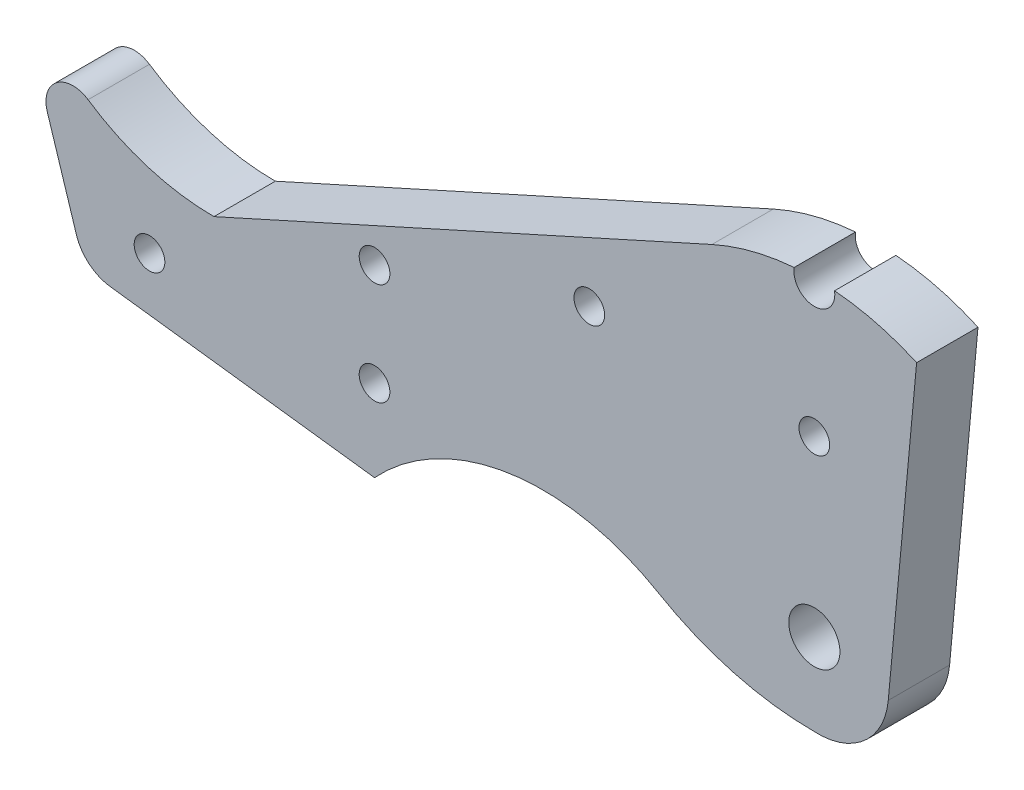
ISO-10303-21;
HEADER;
FILE_DESCRIPTION(('STEP AP214'),'2;1');
FILE_NAME('part.step','',(''),(''),'','','');
FILE_SCHEMA(('AUTOMOTIVE_DESIGN { 1 0 10303 214 1 1 1 1 }'));
ENDSEC;
DATA;
#1=APPLICATION_CONTEXT('core data for automotive mechanical design processes');
#2=APPLICATION_PROTOCOL_DEFINITION('international standard','automotive_design',2000,#1);
#3=PRODUCT_CONTEXT('',#1,'mechanical');
#4=PRODUCT('Part','Part','',(#3));
#5=PRODUCT_RELATED_PRODUCT_CATEGORY('part','',(#4));
#6=PRODUCT_DEFINITION_FORMATION('','',#4);
#7=PRODUCT_DEFINITION_CONTEXT('part definition',#1,'design');
#8=PRODUCT_DEFINITION('design','',#6,#7);
#9=PRODUCT_DEFINITION_SHAPE('','',#8);
#10=(LENGTH_UNIT() NAMED_UNIT(*) SI_UNIT(.MILLI.,.METRE.));
#11=(NAMED_UNIT(*) PLANE_ANGLE_UNIT() SI_UNIT($,.RADIAN.));
#12=(NAMED_UNIT(*) SI_UNIT($,.STERADIAN.) SOLID_ANGLE_UNIT());
#13=UNCERTAINTY_MEASURE_WITH_UNIT(LENGTH_MEASURE(1.E-05),#10,'distance_accuracy_value','');
#14=(GEOMETRIC_REPRESENTATION_CONTEXT(3) GLOBAL_UNCERTAINTY_ASSIGNED_CONTEXT((#13)) GLOBAL_UNIT_ASSIGNED_CONTEXT((#10,
#11,#12)) REPRESENTATION_CONTEXT('',''));
#15=CARTESIAN_POINT('',(0.,0.,0.));
#16=DIRECTION('',(0.,0.,1.));
#17=DIRECTION('',(1.,0.,0.));
#18=AXIS2_PLACEMENT_3D('',#15,#16,#17);
#19=CARTESIAN_POINT('',(74.9933862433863,14.0803286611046,6.));
#20=DIRECTION('',(0.,0.,-1.));
#21=DIRECTION('',(-1.,0.,0.));
#22=AXIS2_PLACEMENT_3D('',#19,#20,#21);
#23=PLANE('',#22);
#24=CARTESIAN_POINT('',(32.,8.,6.));
#25=DIRECTION('',(0.,0.,1.));
#26=DIRECTION('',(1.,0.,0.));
#27=AXIS2_PLACEMENT_3D('',#24,#25,#26);
#28=CIRCLE('',#27,1.5);
#29=CARTESIAN_POINT('',(33.5,8.,6.));
#30=VERTEX_POINT('',#29);
#31=EDGE_CURVE('E330',#30,#30,#28,.T.);
#32=ORIENTED_EDGE('',*,*,#31,.F.);
#33=EDGE_LOOP('',(#32));
#34=FACE_BOUND('',#33,.T.);
#35=CARTESIAN_POINT('',(53.,25.,6.));
#36=DIRECTION('',(0.,0.,1.));
#37=DIRECTION('',(1.,0.,0.));
#38=AXIS2_PLACEMENT_3D('',#35,#36,#37);
#39=CIRCLE('',#38,1.5);
#40=CARTESIAN_POINT('',(54.5,25.,6.));
#41=VERTEX_POINT('',#40);
#42=EDGE_CURVE('E342',#41,#41,#39,.T.);
#43=ORIENTED_EDGE('',*,*,#42,.F.);
#44=EDGE_LOOP('',(#43));
#45=FACE_BOUND('',#44,.T.);
#46=CARTESIAN_POINT('',(75.,25.,6.));
#47=DIRECTION('',(0.,0.,1.));
#48=DIRECTION('',(1.,0.,0.));
#49=AXIS2_PLACEMENT_3D('',#46,#47,#48);
#50=CIRCLE('',#49,1.5);
#51=CARTESIAN_POINT('',(76.5,25.,6.));
#52=VERTEX_POINT('',#51);
#53=EDGE_CURVE('E144',#52,#52,#50,.T.);
#54=ORIENTED_EDGE('',*,*,#53,.F.);
#55=EDGE_LOOP('',(#54));
#56=FACE_BOUND('',#55,.T.);
#57=CARTESIAN_POINT('',(74.9933862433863,14.0803286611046,6.));
#58=DIRECTION('',(0.,0.,1.));
#59=DIRECTION('',(-1.,0.,0.));
#60=AXIS2_PLACEMENT_3D('',#57,#58,#59);
#61=CIRCLE('',#60,24.3141337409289);
#62=CARTESIAN_POINT('',(85.,36.2398589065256,6.));
#63=VERTEX_POINT('',#62);
#64=CARTESIAN_POINT('',(76.9752679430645,38.3135547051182,6.));
#65=VERTEX_POINT('',#64);
#66=EDGE_CURVE('E172',#63,#65,#61,.T.);
#67=ORIENTED_EDGE('',*,*,#66,.T.);
#68=CARTESIAN_POINT('',(75.,38.,6.));
#69=DIRECTION('',(0.,0.,-1.));
#70=DIRECTION('',(1.,0.,0.));
#71=AXIS2_PLACEMENT_3D('',#68,#69,#70);
#72=CIRCLE('',#71,2.00000000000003);
#73=CARTESIAN_POINT('',(73.0249057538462,38.3146469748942,6.));
#74=VERTEX_POINT('',#73);
#75=EDGE_CURVE('E139',#65,#74,#72,.T.);
#76=ORIENTED_EDGE('',*,*,#75,.T.);
#77=CARTESIAN_POINT('',(74.9933862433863,14.0803286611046,6.));
#78=DIRECTION('',(0.,0.,1.));
#79=DIRECTION('',(-1.,0.,0.));
#80=AXIS2_PLACEMENT_3D('',#77,#78,#79);
#81=CIRCLE('',#80,24.3141337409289);
#82=CARTESIAN_POINT('',(64.9867724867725,36.2398589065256,6.));
#83=VERTEX_POINT('',#82);
#84=EDGE_CURVE('E175',#74,#83,#81,.T.);
#85=ORIENTED_EDGE('',*,*,#84,.T.);
#86=DIRECTION('',(-0.911384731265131,-0.411555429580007,0.));
#87=VECTOR('',#86,1.);
#88=CARTESIAN_POINT('',(16.3045020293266,14.2563298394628,6.));
#89=LINE('',#88,#87);
#90=CARTESIAN_POINT('',(16.3045020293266,14.2563298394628,6.));
#91=VERTEX_POINT('',#90);
#92=EDGE_CURVE('E177',#83,#91,#89,.T.);
#93=ORIENTED_EDGE('',*,*,#92,.T.);
#94=CARTESIAN_POINT('',(16.3045020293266,36.3650824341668,6.));
#95=DIRECTION('',(0.,0.,-1.));
#96=DIRECTION('',(1.,0.,0.));
#97=AXIS2_PLACEMENT_3D('',#94,#95,#96);
#98=CIRCLE('',#97,22.1087525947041);
#99=CARTESIAN_POINT('',(3.99512802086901,18.,6.));
#100=VERTEX_POINT('',#99);
#101=EDGE_CURVE('E179',#91,#100,#98,.T.);
#102=ORIENTED_EDGE('',*,*,#101,.T.);
#103=CARTESIAN_POINT('',(2.5220277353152,15.8021946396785,6.));
#104=DIRECTION('',(0.,0.,1.));
#105=DIRECTION('',(-1.,0.,0.));
#106=AXIS2_PLACEMENT_3D('',#103,#104,#105);
#107=CIRCLE('',#106,2.64582177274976);
#108=CARTESIAN_POINT('',(0.,15.0023515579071,6.));
#109=VERTEX_POINT('',#108);
#110=EDGE_CURVE('E181',#100,#109,#107,.T.);
#111=ORIENTED_EDGE('',*,*,#110,.T.);
#112=DIRECTION('',(0.302304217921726,-0.95321149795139,0.));
#113=VECTOR('',#112,1.);
#114=CARTESIAN_POINT('',(2.77336860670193,6.25749559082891,6.));
#115=LINE('',#114,#113);
#116=CARTESIAN_POINT('',(2.77336860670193,6.25749559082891,6.));
#117=VERTEX_POINT('',#116);
#118=EDGE_CURVE('E183',#109,#117,#115,.T.);
#119=ORIENTED_EDGE('',*,*,#118,.T.);
#120=CARTESIAN_POINT('',(6.64532091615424,7.21700234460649,6.));
#121=DIRECTION('',(0.,0.,1.));
#122=DIRECTION('',(-1.,0.,0.));
#123=AXIS2_PLACEMENT_3D('',#120,#121,#122);
#124=CIRCLE('',#123,3.98906855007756);
#125=CARTESIAN_POINT('',(6.14638447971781,3.25925925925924,6.));
#126=VERTEX_POINT('',#125);
#127=EDGE_CURVE('E185',#117,#126,#124,.T.);
#128=ORIENTED_EDGE('',*,*,#127,.T.);
#129=DIRECTION('',(0.99214717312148,-0.125075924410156,0.));
#130=VECTOR('',#129,1.);
#131=CARTESIAN_POINT('',(32.,0.,6.));
#132=LINE('',#131,#130);
#133=CARTESIAN_POINT('',(32.,0.,6.));
#134=VERTEX_POINT('',#133);
#135=EDGE_CURVE('E187',#126,#134,#132,.T.);
#136=ORIENTED_EDGE('',*,*,#135,.T.);
#137=CARTESIAN_POINT('',(48.4415737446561,-15.1903730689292,6.));
#138=DIRECTION('',(0.,0.,-1.));
#139=DIRECTION('',(1.,0.,0.));
#140=AXIS2_PLACEMENT_3D('',#137,#138,#139);
#141=CIRCLE('',#140,22.3846550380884);
#142=CARTESIAN_POINT('',(59.7398589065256,4.13374485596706,6.));
#143=VERTEX_POINT('',#142);
#144=EDGE_CURVE('E189',#134,#143,#141,.T.);
#145=ORIENTED_EDGE('',*,*,#144,.T.);
#146=CARTESIAN_POINT('',(75.,30.234056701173,6.));
#147=DIRECTION('',(0.,0.,1.));
#148=DIRECTION('',(-1.,0.,0.));
#149=AXIS2_PLACEMENT_3D('',#146,#147,#148);
#150=CIRCLE('',#149,30.234056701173);
#151=CARTESIAN_POINT('',(75.,0.,6.));
#152=VERTEX_POINT('',#151);
#153=EDGE_CURVE('E191',#143,#152,#150,.T.);
#154=ORIENTED_EDGE('',*,*,#153,.T.);
#155=CARTESIAN_POINT('',(75.3536604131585,6.89324540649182,6.));
#156=DIRECTION('',(0.,0.,1.));
#157=DIRECTION('',(-1.,0.,0.));
#158=AXIS2_PLACEMENT_3D('',#155,#156,#157);
#159=CIRCLE('',#158,6.9023117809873);
#160=CARTESIAN_POINT('',(82.2266313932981,6.25749559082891,6.));
#161=VERTEX_POINT('',#160);
#162=EDGE_CURVE('E50',#152,#161,#159,.T.);
#163=ORIENTED_EDGE('',*,*,#162,.T.);
#164=DIRECTION('',(0.0921067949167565,0.995749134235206,0.));
#165=VECTOR('',#164,1.);
#166=CARTESIAN_POINT('',(85.,36.2398589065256,6.));
#167=LINE('',#166,#165);
#168=EDGE_CURVE('E45',#161,#63,#167,.T.);
#169=ORIENTED_EDGE('',*,*,#168,.T.);
#170=EDGE_LOOP('',(#67,#76,#85,#93,#102,#111,#119,#128,#136,#145,#154,#163,#169));
#171=FACE_BOUND('',#170,.T.);
#172=CARTESIAN_POINT('',(75.,8.,6.));
#173=DIRECTION('',(0.,0.,1.));
#174=DIRECTION('',(1.,0.,0.));
#175=AXIS2_PLACEMENT_3D('',#172,#173,#174);
#176=CIRCLE('',#175,2.5);
#177=CARTESIAN_POINT('',(77.5,8.,6.));
#178=VERTEX_POINT('',#177);
#179=EDGE_CURVE('E348',#178,#178,#176,.T.);
#180=ORIENTED_EDGE('',*,*,#179,.F.);
#181=EDGE_LOOP('',(#180));
#182=FACE_BOUND('',#181,.T.);
#183=CARTESIAN_POINT('',(32.,18.,6.));
#184=DIRECTION('',(0.,0.,1.));
#185=DIRECTION('',(1.,0.,0.));
#186=AXIS2_PLACEMENT_3D('',#183,#184,#185);
#187=CIRCLE('',#186,1.5);
#188=CARTESIAN_POINT('',(33.5,18.,6.));
#189=VERTEX_POINT('',#188);
#190=EDGE_CURVE('E336',#189,#189,#187,.T.);
#191=ORIENTED_EDGE('',*,*,#190,.F.);
#192=EDGE_LOOP('',(#191));
#193=FACE_BOUND('',#192,.T.);
#194=CARTESIAN_POINT('',(10.,8.,6.));
#195=DIRECTION('',(0.,0.,1.));
#196=DIRECTION('',(1.,0.,0.));
#197=AXIS2_PLACEMENT_3D('',#194,#195,#196);
#198=CIRCLE('',#197,1.5);
#199=CARTESIAN_POINT('',(11.5,8.,6.));
#200=VERTEX_POINT('',#199);
#201=EDGE_CURVE('E319',#200,#200,#198,.T.);
#202=ORIENTED_EDGE('',*,*,#201,.F.);
#203=EDGE_LOOP('',(#202));
#204=FACE_BOUND('',#203,.T.);
#205=ADVANCED_FACE('F30',(#34,#45,#56,#171,#182,#193,#204),#23,.F.);
#206=CARTESIAN_POINT('',(74.9933862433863,14.0803286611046,0.));
#207=DIRECTION('',(0.,0.,-1.));
#208=DIRECTION('',(-1.,0.,0.));
#209=AXIS2_PLACEMENT_3D('',#206,#207,#208);
#210=PLANE('',#209);
#211=CARTESIAN_POINT('',(32.,8.,0.));
#212=DIRECTION('',(0.,0.,1.));
#213=DIRECTION('',(1.,0.,0.));
#214=AXIS2_PLACEMENT_3D('',#211,#212,#213);
#215=CIRCLE('',#214,1.5);
#216=CARTESIAN_POINT('',(33.5,8.,0.));
#217=VERTEX_POINT('',#216);
#218=EDGE_CURVE('E325',#217,#217,#215,.T.);
#219=ORIENTED_EDGE('',*,*,#218,.T.);
#220=EDGE_LOOP('',(#219));
#221=FACE_BOUND('',#220,.T.);
#222=CARTESIAN_POINT('',(53.,25.,0.));
#223=DIRECTION('',(0.,0.,1.));
#224=DIRECTION('',(1.,0.,0.));
#225=AXIS2_PLACEMENT_3D('',#222,#223,#224);
#226=CIRCLE('',#225,1.5);
#227=CARTESIAN_POINT('',(54.5,25.,0.));
#228=VERTEX_POINT('',#227);
#229=EDGE_CURVE('E339',#228,#228,#226,.T.);
#230=ORIENTED_EDGE('',*,*,#229,.T.);
#231=EDGE_LOOP('',(#230));
#232=FACE_BOUND('',#231,.T.);
#233=CARTESIAN_POINT('',(75.,25.,0.));
#234=DIRECTION('',(0.,0.,1.));
#235=DIRECTION('',(1.,0.,0.));
#236=AXIS2_PLACEMENT_3D('',#233,#234,#235);
#237=CIRCLE('',#236,1.5);
#238=CARTESIAN_POINT('',(76.5,25.,0.));
#239=VERTEX_POINT('',#238);
#240=EDGE_CURVE('E147',#239,#239,#237,.T.);
#241=ORIENTED_EDGE('',*,*,#240,.T.);
#242=EDGE_LOOP('',(#241));
#243=FACE_BOUND('',#242,.T.);
#244=CARTESIAN_POINT('',(74.9933862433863,14.0803286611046,0.));
#245=DIRECTION('',(0.,0.,1.));
#246=DIRECTION('',(-1.,0.,0.));
#247=AXIS2_PLACEMENT_3D('',#244,#245,#246);
#248=CIRCLE('',#247,24.3141337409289);
#249=CARTESIAN_POINT('',(85.,36.2398589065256,0.));
#250=VERTEX_POINT('',#249);
#251=CARTESIAN_POINT('',(76.9752679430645,38.3135547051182,0.));
#252=VERTEX_POINT('',#251);
#253=EDGE_CURVE('E130',#250,#252,#248,.T.);
#254=ORIENTED_EDGE('',*,*,#253,.F.);
#255=DIRECTION('',(0.0921067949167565,0.995749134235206,0.));
#256=VECTOR('',#255,1.);
#257=CARTESIAN_POINT('',(85.,36.2398589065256,0.));
#258=LINE('',#257,#256);
#259=CARTESIAN_POINT('',(82.2266313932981,6.25749559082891,0.));
#260=VERTEX_POINT('',#259);
#261=EDGE_CURVE('E170',#260,#250,#258,.T.);
#262=ORIENTED_EDGE('',*,*,#261,.F.);
#263=CARTESIAN_POINT('',(75.3536604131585,6.89324540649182,0.));
#264=DIRECTION('',(0.,0.,1.));
#265=DIRECTION('',(-1.,0.,0.));
#266=AXIS2_PLACEMENT_3D('',#263,#264,#265);
#267=CIRCLE('',#266,6.9023117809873);
#268=CARTESIAN_POINT('',(75.,0.,0.));
#269=VERTEX_POINT('',#268);
#270=EDGE_CURVE('E168',#269,#260,#267,.T.);
#271=ORIENTED_EDGE('',*,*,#270,.F.);
#272=CARTESIAN_POINT('',(75.,30.234056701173,0.));
#273=DIRECTION('',(0.,0.,1.));
#274=DIRECTION('',(-1.,0.,0.));
#275=AXIS2_PLACEMENT_3D('',#272,#273,#274);
#276=CIRCLE('',#275,30.234056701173);
#277=CARTESIAN_POINT('',(59.7398589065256,4.13374485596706,0.));
#278=VERTEX_POINT('',#277);
#279=EDGE_CURVE('E166',#278,#269,#276,.T.);
#280=ORIENTED_EDGE('',*,*,#279,.F.);
#281=CARTESIAN_POINT('',(48.4415737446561,-15.1903730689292,0.));
#282=DIRECTION('',(0.,0.,-1.));
#283=DIRECTION('',(1.,0.,0.));
#284=AXIS2_PLACEMENT_3D('',#281,#282,#283);
#285=CIRCLE('',#284,22.3846550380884);
#286=CARTESIAN_POINT('',(32.,0.,0.));
#287=VERTEX_POINT('',#286);
#288=EDGE_CURVE('E164',#287,#278,#285,.T.);
#289=ORIENTED_EDGE('',*,*,#288,.F.);
#290=DIRECTION('',(0.99214717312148,-0.125075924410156,0.));
#291=VECTOR('',#290,1.);
#292=CARTESIAN_POINT('',(32.,0.,0.));
#293=LINE('',#292,#291);
#294=CARTESIAN_POINT('',(6.14638447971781,3.25925925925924,0.));
#295=VERTEX_POINT('',#294);
#296=EDGE_CURVE('E162',#295,#287,#293,.T.);
#297=ORIENTED_EDGE('',*,*,#296,.F.);
#298=CARTESIAN_POINT('',(6.64532091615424,7.21700234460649,0.));
#299=DIRECTION('',(0.,0.,1.));
#300=DIRECTION('',(-1.,0.,0.));
#301=AXIS2_PLACEMENT_3D('',#298,#299,#300);
#302=CIRCLE('',#301,3.98906855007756);
#303=CARTESIAN_POINT('',(2.77336860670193,6.25749559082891,0.));
#304=VERTEX_POINT('',#303);
#305=EDGE_CURVE('E160',#304,#295,#302,.T.);
#306=ORIENTED_EDGE('',*,*,#305,.F.);
#307=DIRECTION('',(0.302304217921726,-0.95321149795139,0.));
#308=VECTOR('',#307,1.);
#309=CARTESIAN_POINT('',(2.77336860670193,6.25749559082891,0.));
#310=LINE('',#309,#308);
#311=CARTESIAN_POINT('',(0.,15.0023515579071,0.));
#312=VERTEX_POINT('',#311);
#313=EDGE_CURVE('E158',#312,#304,#310,.T.);
#314=ORIENTED_EDGE('',*,*,#313,.F.);
#315=CARTESIAN_POINT('',(2.5220277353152,15.8021946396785,0.));
#316=DIRECTION('',(0.,0.,1.));
#317=DIRECTION('',(-1.,0.,0.));
#318=AXIS2_PLACEMENT_3D('',#315,#316,#317);
#319=CIRCLE('',#318,2.64582177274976);
#320=CARTESIAN_POINT('',(3.99512802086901,18.,0.));
#321=VERTEX_POINT('',#320);
#322=EDGE_CURVE('E156',#321,#312,#319,.T.);
#323=ORIENTED_EDGE('',*,*,#322,.F.);
#324=CARTESIAN_POINT('',(16.3045020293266,36.3650824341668,0.));
#325=DIRECTION('',(0.,0.,-1.));
#326=DIRECTION('',(1.,0.,0.));
#327=AXIS2_PLACEMENT_3D('',#324,#325,#326);
#328=CIRCLE('',#327,22.1087525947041);
#329=CARTESIAN_POINT('',(16.3045020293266,14.2563298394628,0.));
#330=VERTEX_POINT('',#329);
#331=EDGE_CURVE('E154',#330,#321,#328,.T.);
#332=ORIENTED_EDGE('',*,*,#331,.F.);
#333=DIRECTION('',(-0.911384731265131,-0.411555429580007,0.));
#334=VECTOR('',#333,1.);
#335=CARTESIAN_POINT('',(16.3045020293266,14.2563298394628,0.));
#336=LINE('',#335,#334);
#337=CARTESIAN_POINT('',(64.9867724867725,36.2398589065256,0.));
#338=VERTEX_POINT('',#337);
#339=EDGE_CURVE('E152',#338,#330,#336,.T.);
#340=ORIENTED_EDGE('',*,*,#339,.F.);
#341=CARTESIAN_POINT('',(74.9933862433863,14.0803286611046,0.));
#342=DIRECTION('',(0.,0.,1.));
#343=DIRECTION('',(-1.,0.,0.));
#344=AXIS2_PLACEMENT_3D('',#341,#342,#343);
#345=CIRCLE('',#344,24.3141337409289);
#346=CARTESIAN_POINT('',(73.0249057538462,38.3146469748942,0.));
#347=VERTEX_POINT('',#346);
#348=EDGE_CURVE('E132',#347,#338,#345,.T.);
#349=ORIENTED_EDGE('',*,*,#348,.F.);
#350=CARTESIAN_POINT('',(75.,38.,0.));
#351=DIRECTION('',(0.,0.,-1.));
#352=DIRECTION('',(1.,0.,0.));
#353=AXIS2_PLACEMENT_3D('',#350,#351,#352);
#354=CIRCLE('',#353,2.00000000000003);
#355=EDGE_CURVE('E125',#252,#347,#354,.T.);
#356=ORIENTED_EDGE('',*,*,#355,.F.);
#357=EDGE_LOOP('',(#254,#262,#271,#280,#289,#297,#306,#314,#323,#332,#340,#349,#356));
#358=FACE_BOUND('',#357,.T.);
#359=CARTESIAN_POINT('',(75.,8.,0.));
#360=DIRECTION('',(0.,0.,1.));
#361=DIRECTION('',(1.,0.,0.));
#362=AXIS2_PLACEMENT_3D('',#359,#360,#361);
#363=CIRCLE('',#362,2.5);
#364=CARTESIAN_POINT('',(77.5,8.,0.));
#365=VERTEX_POINT('',#364);
#366=EDGE_CURVE('E345',#365,#365,#363,.T.);
#367=ORIENTED_EDGE('',*,*,#366,.T.);
#368=EDGE_LOOP('',(#367));
#369=FACE_BOUND('',#368,.T.);
#370=CARTESIAN_POINT('',(32.,18.,0.));
#371=DIRECTION('',(0.,0.,1.));
#372=DIRECTION('',(1.,0.,0.));
#373=AXIS2_PLACEMENT_3D('',#370,#371,#372);
#374=CIRCLE('',#373,1.5);
#375=CARTESIAN_POINT('',(33.5,18.,0.));
#376=VERTEX_POINT('',#375);
#377=EDGE_CURVE('E333',#376,#376,#374,.T.);
#378=ORIENTED_EDGE('',*,*,#377,.T.);
#379=EDGE_LOOP('',(#378));
#380=FACE_BOUND('',#379,.T.);
#381=CARTESIAN_POINT('',(10.,8.,0.));
#382=DIRECTION('',(0.,0.,1.));
#383=DIRECTION('',(1.,0.,0.));
#384=AXIS2_PLACEMENT_3D('',#381,#382,#383);
#385=CIRCLE('',#384,1.5);
#386=CARTESIAN_POINT('',(11.5,8.,0.));
#387=VERTEX_POINT('',#386);
#388=EDGE_CURVE('E322',#387,#387,#385,.T.);
#389=ORIENTED_EDGE('',*,*,#388,.T.);
#390=EDGE_LOOP('',(#389));
#391=FACE_BOUND('',#390,.T.);
#392=ADVANCED_FACE('F126',(#221,#232,#243,#358,#369,#380,#391),#210,.T.);
#393=CARTESIAN_POINT('',(74.9933862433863,14.0803286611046,6.));
#394=DIRECTION('',(0.,0.,-1.));
#395=DIRECTION('',(-1.,0.,0.));
#396=AXIS2_PLACEMENT_3D('',#393,#394,#395);
#397=CYLINDRICAL_SURFACE('',#396,24.3141337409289);
#398=ORIENTED_EDGE('',*,*,#253,.T.);
#399=DIRECTION('',(0.,0.,-1.));
#400=VECTOR('',#399,1.);
#401=CARTESIAN_POINT('',(76.9752679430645,38.3135547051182,6.));
#402=LINE('',#401,#400);
#403=EDGE_CURVE('E11',#65,#252,#402,.T.);
#404=ORIENTED_EDGE('',*,*,#403,.F.);
#405=ORIENTED_EDGE('',*,*,#66,.F.);
#406=DIRECTION('',(0.,0.,-1.));
#407=VECTOR('',#406,1.);
#408=CARTESIAN_POINT('',(85.,36.2398589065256,6.));
#409=LINE('',#408,#407);
#410=EDGE_CURVE('E143',#63,#250,#409,.T.);
#411=ORIENTED_EDGE('',*,*,#410,.T.);
#412=EDGE_LOOP('',(#398,#404,#405,#411));
#413=FACE_BOUND('',#412,.T.);
#414=ADVANCED_FACE('F32',(#413),#397,.T.);
#415=CARTESIAN_POINT('',(75.,38.,6.));
#416=DIRECTION('',(0.,0.,-1.));
#417=DIRECTION('',(-1.,0.,0.));
#418=AXIS2_PLACEMENT_3D('',#415,#416,#417);
#419=CYLINDRICAL_SURFACE('',#418,2.00000000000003);
#420=ORIENTED_EDGE('',*,*,#355,.T.);
#421=DIRECTION('',(0.,0.,-1.));
#422=VECTOR('',#421,1.);
#423=CARTESIAN_POINT('',(73.0249057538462,38.3146469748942,6.));
#424=LINE('',#423,#422);
#425=EDGE_CURVE('E38',#74,#347,#424,.T.);
#426=ORIENTED_EDGE('',*,*,#425,.F.);
#427=ORIENTED_EDGE('',*,*,#75,.F.);
#428=ORIENTED_EDGE('',*,*,#403,.T.);
#429=EDGE_LOOP('',(#420,#426,#427,#428));
#430=FACE_BOUND('',#429,.T.);
#431=ADVANCED_FACE('F138',(#430),#419,.F.);
#432=CARTESIAN_POINT('',(74.9933862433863,14.0803286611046,6.));
#433=DIRECTION('',(0.,0.,-1.));
#434=DIRECTION('',(-1.,0.,0.));
#435=AXIS2_PLACEMENT_3D('',#432,#433,#434);
#436=CYLINDRICAL_SURFACE('',#435,24.3141337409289);
#437=ORIENTED_EDGE('',*,*,#348,.T.);
#438=DIRECTION('',(0.,0.,-1.));
#439=VECTOR('',#438,1.);
#440=CARTESIAN_POINT('',(64.9867724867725,36.2398589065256,6.));
#441=LINE('',#440,#439);
#442=EDGE_CURVE('E223',#83,#338,#441,.T.);
#443=ORIENTED_EDGE('',*,*,#442,.F.);
#444=ORIENTED_EDGE('',*,*,#84,.F.);
#445=ORIENTED_EDGE('',*,*,#425,.T.);
#446=EDGE_LOOP('',(#437,#443,#444,#445));
#447=FACE_BOUND('',#446,.T.);
#448=ADVANCED_FACE('F227',(#447),#436,.T.);
#449=CARTESIAN_POINT('',(16.3045020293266,14.2563298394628,6.));
#450=DIRECTION('',(0.411555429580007,-0.911384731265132,0.));
#451=DIRECTION('',(0.911384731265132,0.411555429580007,0.));
#452=AXIS2_PLACEMENT_3D('',#449,#450,#451);
#453=PLANE('',#452);
#454=ORIENTED_EDGE('',*,*,#339,.T.);
#455=DIRECTION('',(0.,0.,-1.));
#456=VECTOR('',#455,1.);
#457=CARTESIAN_POINT('',(16.3045020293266,14.2563298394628,6.));
#458=LINE('',#457,#456);
#459=EDGE_CURVE('E220',#91,#330,#458,.T.);
#460=ORIENTED_EDGE('',*,*,#459,.F.);
#461=ORIENTED_EDGE('',*,*,#92,.F.);
#462=ORIENTED_EDGE('',*,*,#442,.T.);
#463=EDGE_LOOP('',(#454,#460,#461,#462));
#464=FACE_BOUND('',#463,.T.);
#465=ADVANCED_FACE('F235',(#464),#453,.F.);
#466=CARTESIAN_POINT('',(16.3045020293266,36.3650824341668,6.));
#467=DIRECTION('',(0.,0.,-1.));
#468=DIRECTION('',(-1.,0.,0.));
#469=AXIS2_PLACEMENT_3D('',#466,#467,#468);
#470=CYLINDRICAL_SURFACE('',#469,22.1087525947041);
#471=ORIENTED_EDGE('',*,*,#331,.T.);
#472=DIRECTION('',(0.,0.,-1.));
#473=VECTOR('',#472,1.);
#474=CARTESIAN_POINT('',(3.99512802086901,18.,6.));
#475=LINE('',#474,#473);
#476=EDGE_CURVE('E217',#100,#321,#475,.T.);
#477=ORIENTED_EDGE('',*,*,#476,.F.);
#478=ORIENTED_EDGE('',*,*,#101,.F.);
#479=ORIENTED_EDGE('',*,*,#459,.T.);
#480=EDGE_LOOP('',(#471,#477,#478,#479));
#481=FACE_BOUND('',#480,.T.);
#482=ADVANCED_FACE('F238',(#481),#470,.F.);
#483=CARTESIAN_POINT('',(2.5220277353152,15.8021946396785,6.));
#484=DIRECTION('',(0.,0.,-1.));
#485=DIRECTION('',(-1.,0.,0.));
#486=AXIS2_PLACEMENT_3D('',#483,#484,#485);
#487=CYLINDRICAL_SURFACE('',#486,2.64582177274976);
#488=ORIENTED_EDGE('',*,*,#322,.T.);
#489=DIRECTION('',(0.,0.,-1.));
#490=VECTOR('',#489,1.);
#491=CARTESIAN_POINT('',(0.,15.0023515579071,6.));
#492=LINE('',#491,#490);
#493=EDGE_CURVE('E214',#109,#312,#492,.T.);
#494=ORIENTED_EDGE('',*,*,#493,.F.);
#495=ORIENTED_EDGE('',*,*,#110,.F.);
#496=ORIENTED_EDGE('',*,*,#476,.T.);
#497=EDGE_LOOP('',(#488,#494,#495,#496));
#498=FACE_BOUND('',#497,.T.);
#499=ADVANCED_FACE('F243',(#498),#487,.T.);
#500=CARTESIAN_POINT('',(2.77336860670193,6.25749559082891,6.));
#501=DIRECTION('',(0.953211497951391,0.302304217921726,0.));
#502=DIRECTION('',(-0.302304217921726,0.953211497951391,0.));
#503=AXIS2_PLACEMENT_3D('',#500,#501,#502);
#504=PLANE('',#503);
#505=ORIENTED_EDGE('',*,*,#313,.T.);
#506=DIRECTION('',(0.,0.,-1.));
#507=VECTOR('',#506,1.);
#508=CARTESIAN_POINT('',(2.77336860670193,6.25749559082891,6.));
#509=LINE('',#508,#507);
#510=EDGE_CURVE('E211',#117,#304,#509,.T.);
#511=ORIENTED_EDGE('',*,*,#510,.F.);
#512=ORIENTED_EDGE('',*,*,#118,.F.);
#513=ORIENTED_EDGE('',*,*,#493,.T.);
#514=EDGE_LOOP('',(#505,#511,#512,#513));
#515=FACE_BOUND('',#514,.T.);
#516=ADVANCED_FACE('F249',(#515),#504,.F.);
#517=CARTESIAN_POINT('',(6.64532091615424,7.21700234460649,6.));
#518=DIRECTION('',(0.,0.,-1.));
#519=DIRECTION('',(-1.,0.,0.));
#520=AXIS2_PLACEMENT_3D('',#517,#518,#519);
#521=CYLINDRICAL_SURFACE('',#520,3.98906855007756);
#522=ORIENTED_EDGE('',*,*,#305,.T.);
#523=DIRECTION('',(0.,0.,-1.));
#524=VECTOR('',#523,1.);
#525=CARTESIAN_POINT('',(6.14638447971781,3.25925925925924,6.));
#526=LINE('',#525,#524);
#527=EDGE_CURVE('E208',#126,#295,#526,.T.);
#528=ORIENTED_EDGE('',*,*,#527,.F.);
#529=ORIENTED_EDGE('',*,*,#127,.F.);
#530=ORIENTED_EDGE('',*,*,#510,.T.);
#531=EDGE_LOOP('',(#522,#528,#529,#530));
#532=FACE_BOUND('',#531,.T.);
#533=ADVANCED_FACE('F253',(#532),#521,.T.);
#534=CARTESIAN_POINT('',(32.,0.,6.));
#535=DIRECTION('',(0.125075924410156,0.99214717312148,0.));
#536=DIRECTION('',(-0.99214717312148,0.125075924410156,0.));
#537=AXIS2_PLACEMENT_3D('',#534,#535,#536);
#538=PLANE('',#537);
#539=ORIENTED_EDGE('',*,*,#296,.T.);
#540=DIRECTION('',(0.,0.,-1.));
#541=VECTOR('',#540,1.);
#542=CARTESIAN_POINT('',(32.,0.,6.));
#543=LINE('',#542,#541);
#544=EDGE_CURVE('E205',#134,#287,#543,.T.);
#545=ORIENTED_EDGE('',*,*,#544,.F.);
#546=ORIENTED_EDGE('',*,*,#135,.F.);
#547=ORIENTED_EDGE('',*,*,#527,.T.);
#548=EDGE_LOOP('',(#539,#545,#546,#547));
#549=FACE_BOUND('',#548,.T.);
#550=ADVANCED_FACE('F258',(#549),#538,.F.);
#551=CARTESIAN_POINT('',(48.4415737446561,-15.1903730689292,6.));
#552=DIRECTION('',(0.,0.,-1.));
#553=DIRECTION('',(-1.,0.,0.));
#554=AXIS2_PLACEMENT_3D('',#551,#552,#553);
#555=CYLINDRICAL_SURFACE('',#554,22.3846550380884);
#556=ORIENTED_EDGE('',*,*,#288,.T.);
#557=DIRECTION('',(0.,0.,-1.));
#558=VECTOR('',#557,1.);
#559=CARTESIAN_POINT('',(59.7398589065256,4.13374485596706,6.));
#560=LINE('',#559,#558);
#561=EDGE_CURVE('E202',#143,#278,#560,.T.);
#562=ORIENTED_EDGE('',*,*,#561,.F.);
#563=ORIENTED_EDGE('',*,*,#144,.F.);
#564=ORIENTED_EDGE('',*,*,#544,.T.);
#565=EDGE_LOOP('',(#556,#562,#563,#564));
#566=FACE_BOUND('',#565,.T.);
#567=ADVANCED_FACE('F264',(#566),#555,.F.);
#568=CARTESIAN_POINT('',(75.,30.234056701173,6.));
#569=DIRECTION('',(0.,0.,-1.));
#570=DIRECTION('',(-1.,0.,0.));
#571=AXIS2_PLACEMENT_3D('',#568,#569,#570);
#572=CYLINDRICAL_SURFACE('',#571,30.234056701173);
#573=ORIENTED_EDGE('',*,*,#279,.T.);
#574=DIRECTION('',(0.,0.,-1.));
#575=VECTOR('',#574,1.);
#576=CARTESIAN_POINT('',(75.,0.,6.));
#577=LINE('',#576,#575);
#578=EDGE_CURVE('E199',#152,#269,#577,.T.);
#579=ORIENTED_EDGE('',*,*,#578,.F.);
#580=ORIENTED_EDGE('',*,*,#153,.F.);
#581=ORIENTED_EDGE('',*,*,#561,.T.);
#582=EDGE_LOOP('',(#573,#579,#580,#581));
#583=FACE_BOUND('',#582,.T.);
#584=ADVANCED_FACE('F268',(#583),#572,.T.);
#585=CARTESIAN_POINT('',(75.3536604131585,6.89324540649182,6.));
#586=DIRECTION('',(0.,0.,-1.));
#587=DIRECTION('',(-1.,0.,0.));
#588=AXIS2_PLACEMENT_3D('',#585,#586,#587);
#589=CYLINDRICAL_SURFACE('',#588,6.9023117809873);
#590=ORIENTED_EDGE('',*,*,#270,.T.);
#591=DIRECTION('',(0.,0.,-1.));
#592=VECTOR('',#591,1.);
#593=CARTESIAN_POINT('',(82.2266313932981,6.25749559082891,6.));
#594=LINE('',#593,#592);
#595=EDGE_CURVE('E196',#161,#260,#594,.T.);
#596=ORIENTED_EDGE('',*,*,#595,.F.);
#597=ORIENTED_EDGE('',*,*,#162,.F.);
#598=ORIENTED_EDGE('',*,*,#578,.T.);
#599=EDGE_LOOP('',(#590,#596,#597,#598));
#600=FACE_BOUND('',#599,.T.);
#601=ADVANCED_FACE('F271',(#600),#589,.T.);
#602=CARTESIAN_POINT('',(85.,36.2398589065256,6.));
#603=DIRECTION('',(-0.995749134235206,0.0921067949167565,0.));
#604=DIRECTION('',(-0.0921067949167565,-0.995749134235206,0.));
#605=AXIS2_PLACEMENT_3D('',#602,#603,#604);
#606=PLANE('',#605);
#607=ORIENTED_EDGE('',*,*,#261,.T.);
#608=ORIENTED_EDGE('',*,*,#410,.F.);
#609=ORIENTED_EDGE('',*,*,#168,.F.);
#610=ORIENTED_EDGE('',*,*,#595,.T.);
#611=EDGE_LOOP('',(#607,#608,#609,#610));
#612=FACE_BOUND('',#611,.T.);
#613=ADVANCED_FACE('F273',(#612),#606,.F.);
#614=CARTESIAN_POINT('',(75.,25.,6.));
#615=DIRECTION('',(0.,0.,-1.));
#616=DIRECTION('',(-1.,0.,0.));
#617=AXIS2_PLACEMENT_3D('',#614,#615,#616);
#618=CYLINDRICAL_SURFACE('',#617,1.5);
#619=ORIENTED_EDGE('',*,*,#53,.T.);
#620=EDGE_LOOP('',(#619));
#621=FACE_BOUND('',#620,.T.);
#622=ORIENTED_EDGE('',*,*,#240,.F.);
#623=EDGE_LOOP('',(#622));
#624=FACE_BOUND('',#623,.T.);
#625=ADVANCED_FACE('F275',(#621,#624),#618,.F.);
#626=CARTESIAN_POINT('',(75.,8.,6.));
#627=DIRECTION('',(0.,0.,-1.));
#628=DIRECTION('',(-1.,0.,0.));
#629=AXIS2_PLACEMENT_3D('',#626,#627,#628);
#630=CYLINDRICAL_SURFACE('',#629,2.5);
#631=ORIENTED_EDGE('',*,*,#179,.T.);
#632=EDGE_LOOP('',(#631));
#633=FACE_BOUND('',#632,.T.);
#634=ORIENTED_EDGE('',*,*,#366,.F.);
#635=EDGE_LOOP('',(#634));
#636=FACE_BOUND('',#635,.T.);
#637=ADVANCED_FACE('F281',(#633,#636),#630,.F.);
#638=CARTESIAN_POINT('',(53.,25.,6.));
#639=DIRECTION('',(0.,0.,-1.));
#640=DIRECTION('',(-1.,0.,0.));
#641=AXIS2_PLACEMENT_3D('',#638,#639,#640);
#642=CYLINDRICAL_SURFACE('',#641,1.5);
#643=ORIENTED_EDGE('',*,*,#42,.T.);
#644=EDGE_LOOP('',(#643));
#645=FACE_BOUND('',#644,.T.);
#646=ORIENTED_EDGE('',*,*,#229,.F.);
#647=EDGE_LOOP('',(#646));
#648=FACE_BOUND('',#647,.T.);
#649=ADVANCED_FACE('F298',(#645,#648),#642,.F.);
#650=CARTESIAN_POINT('',(32.,18.,6.));
#651=DIRECTION('',(0.,0.,-1.));
#652=DIRECTION('',(-1.,0.,0.));
#653=AXIS2_PLACEMENT_3D('',#650,#651,#652);
#654=CYLINDRICAL_SURFACE('',#653,1.5);
#655=ORIENTED_EDGE('',*,*,#190,.T.);
#656=EDGE_LOOP('',(#655));
#657=FACE_BOUND('',#656,.T.);
#658=ORIENTED_EDGE('',*,*,#377,.F.);
#659=EDGE_LOOP('',(#658));
#660=FACE_BOUND('',#659,.T.);
#661=ADVANCED_FACE('F302',(#657,#660),#654,.F.);
#662=CARTESIAN_POINT('',(32.,8.,6.));
#663=DIRECTION('',(0.,0.,-1.));
#664=DIRECTION('',(-1.,0.,0.));
#665=AXIS2_PLACEMENT_3D('',#662,#663,#664);
#666=CYLINDRICAL_SURFACE('',#665,1.5);
#667=ORIENTED_EDGE('',*,*,#31,.T.);
#668=EDGE_LOOP('',(#667));
#669=FACE_BOUND('',#668,.T.);
#670=ORIENTED_EDGE('',*,*,#218,.F.);
#671=EDGE_LOOP('',(#670));
#672=FACE_BOUND('',#671,.T.);
#673=ADVANCED_FACE('F306',(#669,#672),#666,.F.);
#674=CARTESIAN_POINT('',(10.,8.,6.));
#675=DIRECTION('',(0.,0.,-1.));
#676=DIRECTION('',(-1.,0.,0.));
#677=AXIS2_PLACEMENT_3D('',#674,#675,#676);
#678=CYLINDRICAL_SURFACE('',#677,1.5);
#679=ORIENTED_EDGE('',*,*,#201,.T.);
#680=EDGE_LOOP('',(#679));
#681=FACE_BOUND('',#680,.T.);
#682=ORIENTED_EDGE('',*,*,#388,.F.);
#683=EDGE_LOOP('',(#682));
#684=FACE_BOUND('',#683,.T.);
#685=ADVANCED_FACE('F310',(#681,#684),#678,.F.);
#686=CLOSED_SHELL('',(#205,#392,#414,#431,#448,#465,#482,#499,#516,#533,#550,#567,#584,#601,
#613,#625,#637,#649,#661,#673,#685));
#687=MANIFOLD_SOLID_BREP('B2',#686);
#688=ADVANCED_BREP_SHAPE_REPRESENTATION('',(#18,#687),#14);
#689=SHAPE_DEFINITION_REPRESENTATION(#9,#688);
ENDSEC;
END-ISO-10303-21;
